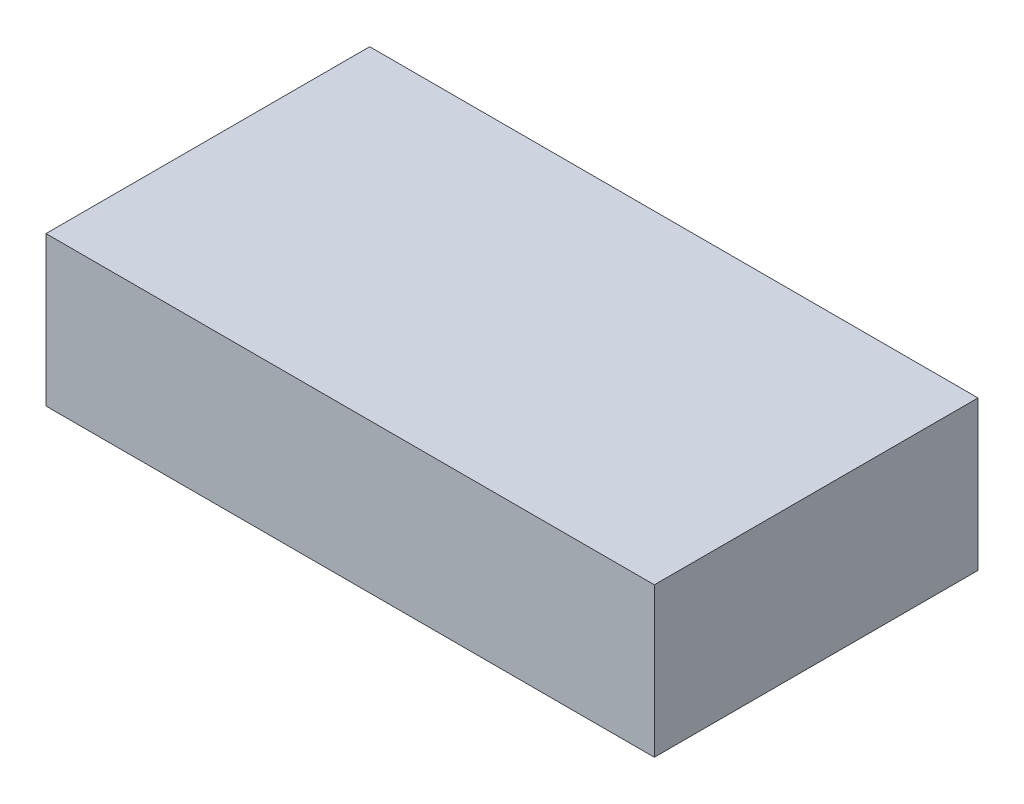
ISO-10303-21;
HEADER;
FILE_DESCRIPTION(('STEP AP214'),'2;1');
FILE_NAME('part.step','',(''),(''),'','','');
FILE_SCHEMA(('AUTOMOTIVE_DESIGN { 1 0 10303 214 1 1 1 1 }'));
ENDSEC;
DATA;
#1=APPLICATION_CONTEXT('core data for automotive mechanical design processes');
#2=APPLICATION_PROTOCOL_DEFINITION('international standard','automotive_design',2000,#1);
#3=PRODUCT_CONTEXT('',#1,'mechanical');
#4=PRODUCT('Part','Part','',(#3));
#5=PRODUCT_RELATED_PRODUCT_CATEGORY('part','',(#4));
#6=PRODUCT_DEFINITION_FORMATION('','',#4);
#7=PRODUCT_DEFINITION_CONTEXT('part definition',#1,'design');
#8=PRODUCT_DEFINITION('design','',#6,#7);
#9=PRODUCT_DEFINITION_SHAPE('','',#8);
#10=(LENGTH_UNIT() NAMED_UNIT(*) SI_UNIT(.MILLI.,.METRE.));
#11=(NAMED_UNIT(*) PLANE_ANGLE_UNIT() SI_UNIT($,.RADIAN.));
#12=(NAMED_UNIT(*) SI_UNIT($,.STERADIAN.) SOLID_ANGLE_UNIT());
#13=UNCERTAINTY_MEASURE_WITH_UNIT(LENGTH_MEASURE(1.E-05),#10,'distance_accuracy_value','');
#14=(GEOMETRIC_REPRESENTATION_CONTEXT(3) GLOBAL_UNCERTAINTY_ASSIGNED_CONTEXT((#13)) GLOBAL_UNIT_ASSIGNED_CONTEXT((#10,
#11,#12)) REPRESENTATION_CONTEXT('',''));
#15=CARTESIAN_POINT('',(0.,0.,0.));
#16=DIRECTION('',(0.,0.,1.));
#17=DIRECTION('',(1.,0.,0.));
#18=AXIS2_PLACEMENT_3D('',#15,#16,#17);
#19=CARTESIAN_POINT('',(-73.3,0.,-78.));
#20=DIRECTION('',(-1.,0.,0.));
#21=DIRECTION('',(0.,0.,1.));
#22=AXIS2_PLACEMENT_3D('',#19,#20,#21);
#23=PLANE('',#22);
#24=DIRECTION('',(0.,-1.,0.));
#25=VECTOR('',#24,1.);
#26=CARTESIAN_POINT('',(-73.3,0.,0.));
#27=LINE('',#26,#25);
#28=CARTESIAN_POINT('',(-73.3,36.,0.));
#29=VERTEX_POINT('',#28);
#30=CARTESIAN_POINT('',(-73.3,0.,0.));
#31=VERTEX_POINT('',#30);
#32=EDGE_CURVE('E97',#29,#31,#27,.T.);
#33=ORIENTED_EDGE('',*,*,#32,.F.);
#34=DIRECTION('',(0.,0.,1.));
#35=VECTOR('',#34,1.);
#36=CARTESIAN_POINT('',(-73.3,36.,-78.));
#37=LINE('',#36,#35);
#38=CARTESIAN_POINT('',(-73.3,36.,-78.));
#39=VERTEX_POINT('',#38);
#40=EDGE_CURVE('E11',#39,#29,#37,.T.);
#41=ORIENTED_EDGE('',*,*,#40,.F.);
#42=DIRECTION('',(0.,-1.,0.));
#43=VECTOR('',#42,1.);
#44=CARTESIAN_POINT('',(-73.3,0.,-78.));
#45=LINE('',#44,#43);
#46=CARTESIAN_POINT('',(-73.3,0.,-78.));
#47=VERTEX_POINT('',#46);
#48=EDGE_CURVE('E91',#39,#47,#45,.T.);
#49=ORIENTED_EDGE('',*,*,#48,.T.);
#50=DIRECTION('',(0.,0.,1.));
#51=VECTOR('',#50,1.);
#52=CARTESIAN_POINT('',(-73.3,0.,-78.));
#53=LINE('',#52,#51);
#54=EDGE_CURVE('E36',#47,#31,#53,.T.);
#55=ORIENTED_EDGE('',*,*,#54,.T.);
#56=EDGE_LOOP('',(#33,#41,#49,#55));
#57=FACE_BOUND('',#56,.T.);
#58=ADVANCED_FACE('F33',(#57),#23,.T.);
#59=CARTESIAN_POINT('',(-73.3,36.,-78.));
#60=DIRECTION('',(0.,1.,0.));
#61=DIRECTION('',(0.,0.,1.));
#62=AXIS2_PLACEMENT_3D('',#59,#60,#61);
#63=PLANE('',#62);
#64=DIRECTION('',(-1.,0.,0.));
#65=VECTOR('',#64,1.);
#66=CARTESIAN_POINT('',(-73.3,36.,0.));
#67=LINE('',#66,#65);
#68=CARTESIAN_POINT('',(73.3,36.,0.));
#69=VERTEX_POINT('',#68);
#70=EDGE_CURVE('E93',#69,#29,#67,.T.);
#71=ORIENTED_EDGE('',*,*,#70,.F.);
#72=DIRECTION('',(0.,0.,1.));
#73=VECTOR('',#72,1.);
#74=CARTESIAN_POINT('',(73.3,36.,-78.));
#75=LINE('',#74,#73);
#76=CARTESIAN_POINT('',(73.3,36.,-78.));
#77=VERTEX_POINT('',#76);
#78=EDGE_CURVE('E42',#77,#69,#75,.T.);
#79=ORIENTED_EDGE('',*,*,#78,.F.);
#80=DIRECTION('',(-1.,0.,0.));
#81=VECTOR('',#80,1.);
#82=CARTESIAN_POINT('',(-73.3,36.,-78.));
#83=LINE('',#82,#81);
#84=EDGE_CURVE('E88',#77,#39,#83,.T.);
#85=ORIENTED_EDGE('',*,*,#84,.T.);
#86=ORIENTED_EDGE('',*,*,#40,.T.);
#87=EDGE_LOOP('',(#71,#79,#85,#86));
#88=FACE_BOUND('',#87,.T.);
#89=ADVANCED_FACE('F107',(#88),#63,.T.);
#90=CARTESIAN_POINT('',(73.3,0.,-78.));
#91=DIRECTION('',(1.,0.,0.));
#92=DIRECTION('',(0.,0.,-1.));
#93=AXIS2_PLACEMENT_3D('',#90,#91,#92);
#94=PLANE('',#93);
#95=DIRECTION('',(0.,1.,0.));
#96=VECTOR('',#95,1.);
#97=CARTESIAN_POINT('',(73.3,0.,0.));
#98=LINE('',#97,#96);
#99=CARTESIAN_POINT('',(73.3,0.,0.));
#100=VERTEX_POINT('',#99);
#101=EDGE_CURVE('E83',#100,#69,#98,.T.);
#102=ORIENTED_EDGE('',*,*,#101,.F.);
#103=DIRECTION('',(0.,0.,1.));
#104=VECTOR('',#103,1.);
#105=CARTESIAN_POINT('',(73.3,0.,-78.));
#106=LINE('',#105,#104);
#107=CARTESIAN_POINT('',(73.3,0.,-78.));
#108=VERTEX_POINT('',#107);
#109=EDGE_CURVE('E78',#108,#100,#106,.T.);
#110=ORIENTED_EDGE('',*,*,#109,.F.);
#111=DIRECTION('',(0.,1.,0.));
#112=VECTOR('',#111,1.);
#113=CARTESIAN_POINT('',(73.3,0.,-78.));
#114=LINE('',#113,#112);
#115=EDGE_CURVE('E81',#108,#77,#114,.T.);
#116=ORIENTED_EDGE('',*,*,#115,.T.);
#117=ORIENTED_EDGE('',*,*,#78,.T.);
#118=EDGE_LOOP('',(#102,#110,#116,#117));
#119=FACE_BOUND('',#118,.T.);
#120=ADVANCED_FACE('F80',(#119),#94,.T.);
#121=CARTESIAN_POINT('',(-73.3,0.,-78.));
#122=DIRECTION('',(0.,-1.,0.));
#123=DIRECTION('',(0.,0.,-1.));
#124=AXIS2_PLACEMENT_3D('',#121,#122,#123);
#125=PLANE('',#124);
#126=DIRECTION('',(1.,0.,0.));
#127=VECTOR('',#126,1.);
#128=CARTESIAN_POINT('',(-73.3,0.,0.));
#129=LINE('',#128,#127);
#130=EDGE_CURVE('E100',#31,#100,#129,.T.);
#131=ORIENTED_EDGE('',*,*,#130,.F.);
#132=ORIENTED_EDGE('',*,*,#54,.F.);
#133=DIRECTION('',(1.,0.,0.));
#134=VECTOR('',#133,1.);
#135=CARTESIAN_POINT('',(-73.3,0.,-78.));
#136=LINE('',#135,#134);
#137=EDGE_CURVE('E87',#47,#108,#136,.T.);
#138=ORIENTED_EDGE('',*,*,#137,.T.);
#139=ORIENTED_EDGE('',*,*,#109,.T.);
#140=EDGE_LOOP('',(#131,#132,#138,#139));
#141=FACE_BOUND('',#140,.T.);
#142=ADVANCED_FACE('F90',(#141),#125,.T.);
#143=CARTESIAN_POINT('',(0.,0.,-78.));
#144=DIRECTION('',(0.,0.,-1.));
#145=DIRECTION('',(-1.,0.,0.));
#146=AXIS2_PLACEMENT_3D('',#143,#144,#145);
#147=PLANE('',#146);
#148=ORIENTED_EDGE('',*,*,#48,.F.);
#149=ORIENTED_EDGE('',*,*,#84,.F.);
#150=ORIENTED_EDGE('',*,*,#115,.F.);
#151=ORIENTED_EDGE('',*,*,#137,.F.);
#152=EDGE_LOOP('',(#148,#149,#150,#151));
#153=FACE_BOUND('',#152,.T.);
#154=ADVANCED_FACE('F86',(#153),#147,.T.);
#155=CARTESIAN_POINT('',(0.,0.,0.));
#156=DIRECTION('',(0.,0.,-1.));
#157=DIRECTION('',(-1.,0.,0.));
#158=AXIS2_PLACEMENT_3D('',#155,#156,#157);
#159=PLANE('',#158);
#160=ORIENTED_EDGE('',*,*,#32,.T.);
#161=ORIENTED_EDGE('',*,*,#130,.T.);
#162=ORIENTED_EDGE('',*,*,#101,.T.);
#163=ORIENTED_EDGE('',*,*,#70,.T.);
#164=EDGE_LOOP('',(#160,#161,#162,#163));
#165=FACE_BOUND('',#164,.T.);
#166=ADVANCED_FACE('F106',(#165),#159,.F.);
#167=CLOSED_SHELL('',(#58,#89,#120,#142,#154,#166));
#168=MANIFOLD_SOLID_BREP('B2',#167);
#169=ADVANCED_BREP_SHAPE_REPRESENTATION('',(#18,#168),#14);
#170=SHAPE_DEFINITION_REPRESENTATION(#9,#169);
ENDSEC;
END-ISO-10303-21;
